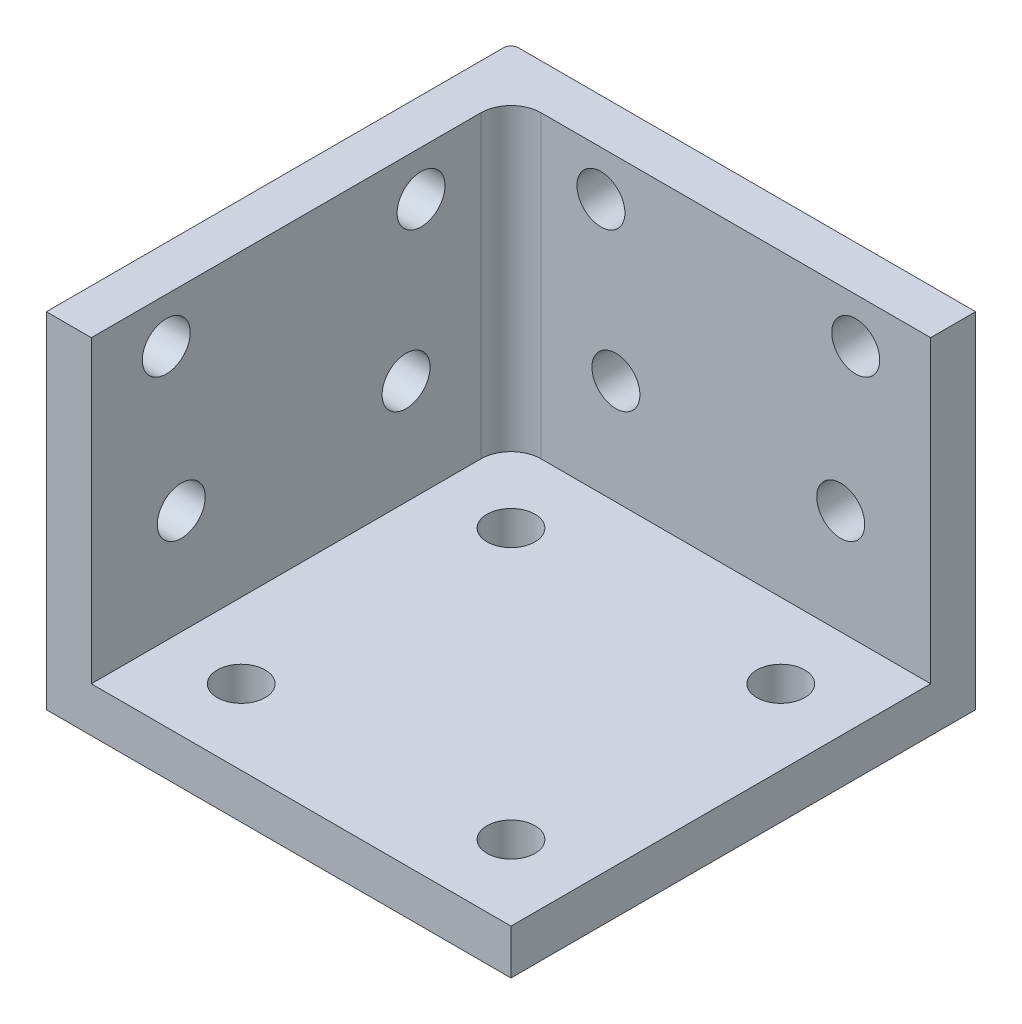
from build123d import *

# Parameters (mm, degrees)
EXTRUDE_1_DEPTH     = 28
SKETCH_2_R          = 1.6
CUT_EXTRUDE_1_DEPTH = 10
SKETCH_3_R          = 1.6
CUT_EXTRUDE_2_DEPTH = 10
SKETCH_5_R          = 1.6
CUT_EXTRUDE_3_DEPTH = 10
SKETCH_6_W          = 31
SKETCH_6_H          = 23
EXTRUDE_2_DEPTH     = 3
SKETCH_7_R          = 1.6
CUT_EXTRUDE_4_DEPTH = 3
FILLET_1_R          = 2
FILLET_3_R          = 0.5


with BuildPart() as part:
    # Sketch 1 → Extrude 1 (new body)
    with BuildSketch(Plane.XY):
        Polygon((0, 0), (0, 23), (3, 23), (3, 3), (31, 3), (31, 0), align=None)
    extrude(amount=EXTRUDE_1_DEPTH)

    # Sketch 2 → Cut-Extrude 1 (cut)
    with BuildSketch(Plane(origin=(3, 0, 0), x_dir=(0, 0, -1), z_dir=(1, 0, 0))):
        with Locations((-23, 20)):
            Circle(SKETCH_2_R)
        with Locations((-6, 20)):
            Circle(SKETCH_2_R)
    extrude(amount=-CUT_EXTRUDE_1_DEPTH, mode=Mode.SUBTRACT)

    # Sketch 3 → Cut-Extrude 2 (cut)
    with BuildSketch(Plane(origin=(3, 0, 0), x_dir=(0, 0, -1), z_dir=(1, 0, 0))):
        with Locations((-22, 10)):
            Circle(SKETCH_3_R)
        with Locations((-7, 10)):
            Circle(SKETCH_3_R)
    extrude(amount=-CUT_EXTRUDE_2_DEPTH, mode=Mode.SUBTRACT)

    # Sketch 5 → Cut-Extrude 3 (cut)
    with BuildSketch(Plane(origin=(0, 3, 0), x_dir=(1, 0, 0), z_dir=(0, 1, 0))):
        with Locations(Location((26, -23, 0), (0, 0, 270))):
            Circle(SKETCH_5_R)
        with Locations(Location((26, -5, 0), (0, 0, 270))):
            Circle(SKETCH_5_R)
        with Locations(Location((8, -23, 0), (0, 0, 270))):
            Circle(SKETCH_5_R)
        with Locations(Location((8, -5, 0), (0, 0, 270))):
            Circle(SKETCH_5_R)
    extrude(amount=-CUT_EXTRUDE_3_DEPTH, mode=Mode.SUBTRACT)

    # Sketch 6 → Extrude 2 (add)
    with BuildSketch(Plane(origin=(0, 0, 0), x_dir=(-1, 0, 0), z_dir=(0, 0, -1))):
        with Locations((-15.5, 11.5)):
            Rectangle(SKETCH_6_W, SKETCH_6_H)
    extrude(amount=EXTRUDE_2_DEPTH)

    # Sketch 7 → Cut-Extrude 4 (cut)
    with BuildSketch(Plane.XY):
        with Locations((26, 20)):
            Circle(SKETCH_7_R)
        with Locations((9, 20)):
            Circle(SKETCH_7_R)
        with Locations((25, 10)):
            Circle(SKETCH_7_R)
        with Locations((10, 10)):
            Circle(SKETCH_7_R)
    extrude(amount=-CUT_EXTRUDE_4_DEPTH, mode=Mode.SUBTRACT)

    # Fillet 1
    fillet_1_edges = [part.edges().sort_by_distance(p)[0] for p in [
        (3, 13, 0),
    ]]
    fillet(fillet_1_edges, radius=FILLET_1_R)

    # Fillet 3
    fillet_3_edges = [part.edges().sort_by_distance(p)[0] for p in [
        (0, 11.5, -3),
    ]]
    fillet(fillet_3_edges, radius=FILLET_3_R)


solid = part.part
